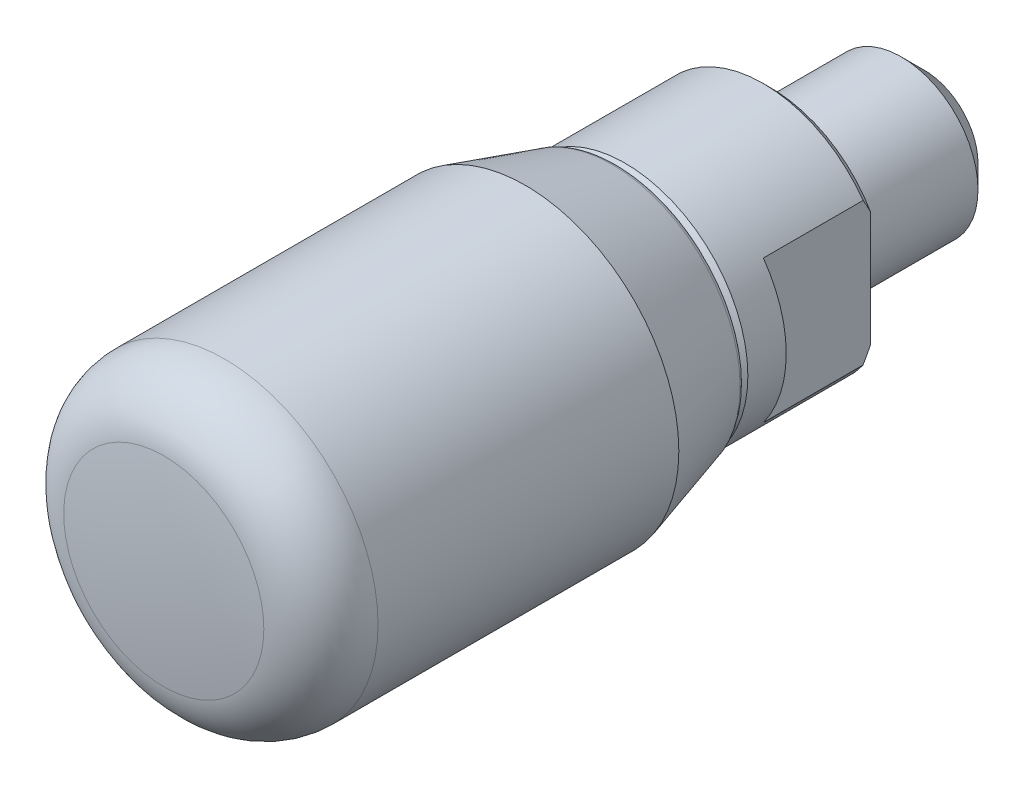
ISO-10303-21;
HEADER;
FILE_DESCRIPTION(('STEP AP214'),'2;1');
FILE_NAME('part.step','',(''),(''),'','','');
FILE_SCHEMA(('AUTOMOTIVE_DESIGN { 1 0 10303 214 1 1 1 1 }'));
ENDSEC;
DATA;
#1=APPLICATION_CONTEXT('core data for automotive mechanical design processes');
#2=APPLICATION_PROTOCOL_DEFINITION('international standard','automotive_design',2000,#1);
#3=PRODUCT_CONTEXT('',#1,'mechanical');
#4=PRODUCT('Part','Part','',(#3));
#5=PRODUCT_RELATED_PRODUCT_CATEGORY('part','',(#4));
#6=PRODUCT_DEFINITION_FORMATION('','',#4);
#7=PRODUCT_DEFINITION_CONTEXT('part definition',#1,'design');
#8=PRODUCT_DEFINITION('design','',#6,#7);
#9=PRODUCT_DEFINITION_SHAPE('','',#8);
#10=(LENGTH_UNIT() NAMED_UNIT(*) SI_UNIT(.MILLI.,.METRE.));
#11=(NAMED_UNIT(*) PLANE_ANGLE_UNIT() SI_UNIT($,.RADIAN.));
#12=(NAMED_UNIT(*) SI_UNIT($,.STERADIAN.) SOLID_ANGLE_UNIT());
#13=UNCERTAINTY_MEASURE_WITH_UNIT(LENGTH_MEASURE(1.E-05),#10,'distance_accuracy_value','');
#14=(GEOMETRIC_REPRESENTATION_CONTEXT(3) GLOBAL_UNCERTAINTY_ASSIGNED_CONTEXT((#13)) GLOBAL_UNIT_ASSIGNED_CONTEXT((#10,
#11,#12)) REPRESENTATION_CONTEXT('',''));
#15=CARTESIAN_POINT('',(0.,0.,0.));
#16=DIRECTION('',(0.,0.,1.));
#17=DIRECTION('',(1.,0.,0.));
#18=AXIS2_PLACEMENT_3D('',#15,#16,#17);
#19=CARTESIAN_POINT('',(0.,7.5,0.));
#20=DIRECTION('',(0.,0.,1.));
#21=DIRECTION('',(1.,0.,0.));
#22=AXIS2_PLACEMENT_3D('',#19,#20,#21);
#23=PLANE('',#22);
#24=CARTESIAN_POINT('',(0.,0.,0.));
#25=DIRECTION('',(0.,0.,1.));
#26=DIRECTION('',(1.,0.,0.));
#27=AXIS2_PLACEMENT_3D('',#24,#25,#26);
#28=CIRCLE('',#27,5.);
#29=CARTESIAN_POINT('',(5.,0.,0.));
#30=VERTEX_POINT('',#29);
#31=EDGE_CURVE('E201',#30,#30,#28,.T.);
#32=ORIENTED_EDGE('',*,*,#31,.T.);
#33=EDGE_LOOP('',(#32));
#34=FACE_BOUND('',#33,.T.);
#35=DIRECTION('',(0.,1.,0.));
#36=VECTOR('',#35,1.);
#37=CARTESIAN_POINT('',(-6.5,4.65000000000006,0.));
#38=LINE('',#37,#36);
#39=CARTESIAN_POINT('',(-6.5,-3.74165738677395,0.));
#40=VERTEX_POINT('',#39);
#41=CARTESIAN_POINT('',(-6.5,3.74165738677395,0.));
#42=VERTEX_POINT('',#41);
#43=EDGE_CURVE('E109',#40,#42,#38,.T.);
#44=ORIENTED_EDGE('',*,*,#43,.T.);
#45=CARTESIAN_POINT('',(0.,0.,0.));
#46=DIRECTION('',(0.,0.,1.));
#47=DIRECTION('',(1.,0.,0.));
#48=AXIS2_PLACEMENT_3D('',#45,#46,#47);
#49=CIRCLE('',#48,7.5);
#50=CARTESIAN_POINT('',(6.5,3.74165738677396,0.));
#51=VERTEX_POINT('',#50);
#52=EDGE_CURVE('E198',#51,#42,#49,.T.);
#53=ORIENTED_EDGE('',*,*,#52,.F.);
#54=DIRECTION('',(0.,1.,0.));
#55=VECTOR('',#54,1.);
#56=CARTESIAN_POINT('',(6.5,4.65000000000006,0.));
#57=LINE('',#56,#55);
#58=CARTESIAN_POINT('',(6.5,-3.74165738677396,0.));
#59=VERTEX_POINT('',#58);
#60=EDGE_CURVE('E228',#59,#51,#57,.T.);
#61=ORIENTED_EDGE('',*,*,#60,.F.);
#62=EDGE_CURVE('E192',#40,#59,#49,.T.);
#63=ORIENTED_EDGE('',*,*,#62,.F.);
#64=EDGE_LOOP('',(#44,#53,#61,#63));
#65=FACE_BOUND('',#64,.T.);
#66=ADVANCED_FACE('F14',(#34,#65),#23,.F.);
#67=CARTESIAN_POINT('',(0.,0.,0.));
#68=DIRECTION('',(0.,0.,1.));
#69=DIRECTION('',(1.,0.,0.));
#70=AXIS2_PLACEMENT_3D('',#67,#68,#69);
#71=CONICAL_SURFACE('',#70,7.5,0.785398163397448);
#72=CARTESIAN_POINT('',(-8.84375391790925,4.65000000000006,2.49172074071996));
#73=CARTESIAN_POINT('',(-8.6508304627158,4.65000000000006,2.32098526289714));
#74=CARTESIAN_POINT('',(-8.4573252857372,4.65000000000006,2.15090150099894));
#75=CARTESIAN_POINT('',(-8.06888646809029,4.65000000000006,1.81237023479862));
#76=CARTESIAN_POINT('',(-7.87395281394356,4.65000000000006,1.64392274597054));
#77=CARTESIAN_POINT('',(-7.48261562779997,4.65000000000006,1.30918824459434));
#78=CARTESIAN_POINT('',(-7.28621399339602,4.65000000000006,1.14289901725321));
#79=CARTESIAN_POINT('',(-6.89137826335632,4.65000000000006,0.812752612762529));
#80=CARTESIAN_POINT('',(-6.69294419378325,4.65000000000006,0.648895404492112));
#81=CARTESIAN_POINT('',(-6.29340367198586,4.65000000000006,0.324057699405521));
#82=CARTESIAN_POINT('',(-6.09229477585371,4.65000000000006,0.163080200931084));
#83=CARTESIAN_POINT('',(-5.68705105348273,4.65000000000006,-0.154982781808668));
#84=CARTESIAN_POINT('',(-5.48291656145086,4.65000000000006,-0.312068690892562));
#85=CARTESIAN_POINT('',(-5.07062725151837,4.65000000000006,-0.62140057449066));
#86=CARTESIAN_POINT('',(-4.86246813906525,4.65000000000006,-0.773640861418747));
#87=CARTESIAN_POINT('',(-4.54663856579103,4.65000000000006,-0.997008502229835));
#88=CARTESIAN_POINT('',(-4.44074311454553,4.65000000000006,-1.0706457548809));
#89=CARTESIAN_POINT('',(-4.22760595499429,4.65000000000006,-1.21596462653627));
#90=CARTESIAN_POINT('',(-4.12036412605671,4.65000000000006,-1.2876460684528));
#91=CARTESIAN_POINT('',(-4.01237778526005,4.65000000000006,-1.35820258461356));
#92=B_SPLINE_CURVE_WITH_KNOTS('',3,(#72,#73,#74,#75,#76,#77,#78,#79,#80,#81,#82,#83,#84,#85,#86,
#87,#88,#89,#90,#91),.UNSPECIFIED.,.F.,.F.,(4,2,2,2,2,2,2,2,2,4),(0.,0.77287569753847,
1.54575869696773,2.31777330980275,3.08977803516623,3.86254458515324,4.63522640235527,
5.40878400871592,5.79570973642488,6.18267038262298),.UNSPECIFIED.);
#93=CARTESIAN_POINT('',(-6.50980030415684,4.65000000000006,0.5));
#94=VERTEX_POINT('',#93);
#95=CARTESIAN_POINT('',(-6.5,4.65000000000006,0.492027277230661));
#96=VERTEX_POINT('',#95);
#97=EDGE_CURVE('E104',#94,#96,#92,.T.);
#98=ORIENTED_EDGE('',*,*,#97,.F.);
#99=CARTESIAN_POINT('',(0.,0.,0.5));
#100=DIRECTION('',(0.,0.,1.));
#101=DIRECTION('',(1.,0.,0.));
#102=AXIS2_PLACEMENT_3D('',#99,#100,#101);
#103=CIRCLE('',#102,8.);
#104=CARTESIAN_POINT('',(6.50980030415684,4.65000000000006,0.5));
#105=VERTEX_POINT('',#104);
#106=EDGE_CURVE('E188',#105,#94,#103,.T.);
#107=ORIENTED_EDGE('',*,*,#106,.F.);
#108=CARTESIAN_POINT('',(8.84375391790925,4.65000000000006,2.49172074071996));
#109=CARTESIAN_POINT('',(8.6508304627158,4.65000000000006,2.32098526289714));
#110=CARTESIAN_POINT('',(8.4573252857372,4.65000000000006,2.15090150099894));
#111=CARTESIAN_POINT('',(8.06888646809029,4.65000000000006,1.81237023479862));
#112=CARTESIAN_POINT('',(7.87395281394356,4.65000000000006,1.64392274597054));
#113=CARTESIAN_POINT('',(7.48261562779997,4.65000000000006,1.30918824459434));
#114=CARTESIAN_POINT('',(7.28621399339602,4.65000000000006,1.14289901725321));
#115=CARTESIAN_POINT('',(6.89137826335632,4.65000000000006,0.81275261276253));
#116=CARTESIAN_POINT('',(6.69294419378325,4.65000000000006,0.648895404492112));
#117=CARTESIAN_POINT('',(6.29340367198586,4.65000000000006,0.32405769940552));
#118=CARTESIAN_POINT('',(6.09229477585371,4.65000000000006,0.163080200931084));
#119=CARTESIAN_POINT('',(5.68705105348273,4.65000000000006,-0.154982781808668));
#120=CARTESIAN_POINT('',(5.48291656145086,4.65000000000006,-0.312068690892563));
#121=CARTESIAN_POINT('',(5.07062725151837,4.65000000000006,-0.62140057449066));
#122=CARTESIAN_POINT('',(4.86246813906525,4.65000000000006,-0.773640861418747));
#123=CARTESIAN_POINT('',(4.54663856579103,4.65000000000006,-0.997008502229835));
#124=CARTESIAN_POINT('',(4.44074311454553,4.65000000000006,-1.0706457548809));
#125=CARTESIAN_POINT('',(4.22760595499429,4.65000000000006,-1.21596462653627));
#126=CARTESIAN_POINT('',(4.12036412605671,4.65000000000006,-1.2876460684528));
#127=CARTESIAN_POINT('',(4.01237778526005,4.65000000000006,-1.35820258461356));
#128=B_SPLINE_CURVE_WITH_KNOTS('',3,(#108,#109,#110,#111,#112,#113,#114,#115,#116,#117,#118,
#119,#120,#121,#122,#123,#124,#125,#126,#127),.UNSPECIFIED.,.F.,.F.,(4,2,2,2,2,2,2,2,2,4),(0.,
0.77287569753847,1.54575869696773,2.31777330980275,3.08977803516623,3.86254458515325,
4.63522640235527,5.40878400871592,5.79570973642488,6.18267038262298),.UNSPECIFIED.);
#129=CARTESIAN_POINT('',(6.5,4.65000000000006,0.492027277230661));
#130=VERTEX_POINT('',#129);
#131=EDGE_CURVE('E222',#105,#130,#128,.T.);
#132=ORIENTED_EDGE('',*,*,#131,.T.);
#133=CARTESIAN_POINT('',(6.5,-10.2382586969,4.62732209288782));
#134=CARTESIAN_POINT('',(6.5,-10.0805675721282,4.49419858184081));
#135=CARTESIAN_POINT('',(6.5,-9.92244567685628,4.36158577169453));
#136=CARTESIAN_POINT('',(6.5,-9.60522522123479,4.09752611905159));
#137=CARTESIAN_POINT('',(6.5,-9.4461266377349,3.9660793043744));
#138=CARTESIAN_POINT('',(6.5,-8.96701551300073,3.57355939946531));
#139=CARTESIAN_POINT('',(6.5,-8.64537396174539,3.3144647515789));
#140=CARTESIAN_POINT('',(6.5,-7.98463041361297,2.79375612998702));
#141=CARTESIAN_POINT('',(6.5,-7.64532241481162,2.53240287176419));
#142=CARTESIAN_POINT('',(6.5,-6.95917981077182,2.01987283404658));
#143=CARTESIAN_POINT('',(6.5,-6.61234731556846,1.76869325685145));
#144=CARTESIAN_POINT('',(6.5,-6.08417080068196,1.40230988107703));
#145=CARTESIAN_POINT('',(6.5,-5.90653957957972,1.28175363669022));
#146=CARTESIAN_POINT('',(6.5,-5.5483970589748,1.04497638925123));
#147=CARTESIAN_POINT('',(6.5,-5.36788571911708,0.928755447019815));
#148=CARTESIAN_POINT('',(6.5,-5.00339058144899,0.701439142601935));
#149=CARTESIAN_POINT('',(6.5,-4.8194033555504,0.590349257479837));
#150=CARTESIAN_POINT('',(6.5,-4.44769324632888,0.374583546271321));
#151=CARTESIAN_POINT('',(6.5,-4.2599704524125,0.269907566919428));
#152=CARTESIAN_POINT('',(6.5,-3.88317362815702,0.069935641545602));
#153=CARTESIAN_POINT('',(6.5,-3.69416215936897,-0.0254775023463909));
#154=CARTESIAN_POINT('',(6.5,-3.31163803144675,-0.206948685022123));
#155=CARTESIAN_POINT('',(6.5,-3.1181248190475,-0.293005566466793));
#156=CARTESIAN_POINT('',(6.5,-2.72674297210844,-0.453486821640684));
#157=CARTESIAN_POINT('',(6.5,-2.52888387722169,-0.527934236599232));
#158=CARTESIAN_POINT('',(6.5,-2.12853570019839,-0.662954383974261));
#159=CARTESIAN_POINT('',(6.5,-1.92604884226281,-0.723533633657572));
#160=CARTESIAN_POINT('',(6.5,-1.51349336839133,-0.829145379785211));
#161=CARTESIAN_POINT('',(6.5,-1.30335505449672,-0.873909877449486));
#162=CARTESIAN_POINT('',(6.5,-0.879838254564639,-0.944044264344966));
#163=CARTESIAN_POINT('',(6.5,-0.666460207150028,-0.969416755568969));
#164=CARTESIAN_POINT('',(6.5,-0.238874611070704,-0.999097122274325));
#165=CARTESIAN_POINT('',(6.5,-0.0246716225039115,-1.00346945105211));
#166=CARTESIAN_POINT('',(6.5,0.403120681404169,-0.991023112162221));
#167=CARTESIAN_POINT('',(6.5,0.616709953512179,-0.974202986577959));
#168=CARTESIAN_POINT('',(6.5,1.03895684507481,-0.920789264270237));
#169=CARTESIAN_POINT('',(6.5,1.24764287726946,-0.884416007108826));
#170=CARTESIAN_POINT('',(6.5,1.66114540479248,-0.79413327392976));
#171=CARTESIAN_POINT('',(6.5,1.86596146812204,-0.740221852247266));
#172=CARTESIAN_POINT('',(6.5,2.27370482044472,-0.616580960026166));
#173=CARTESIAN_POINT('',(6.5,2.47657034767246,-0.546649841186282));
#174=CARTESIAN_POINT('',(6.5,2.77713345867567,-0.432193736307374));
#175=CARTESIAN_POINT('',(6.5,2.876692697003,-0.392451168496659));
#176=CARTESIAN_POINT('',(6.5,3.07460512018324,-0.31006843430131));
#177=CARTESIAN_POINT('',(6.5,3.17295830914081,-0.267428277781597));
#178=CARTESIAN_POINT('',(6.5,3.60701601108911,-0.0723406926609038));
#179=CARTESIAN_POINT('',(6.5,3.93641756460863,0.094220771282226));
#180=CARTESIAN_POINT('',(6.5,4.58347580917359,0.448899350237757));
#181=CARTESIAN_POINT('',(6.5,4.90112133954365,0.637036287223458));
#182=CARTESIAN_POINT('',(6.5,5.52825977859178,1.02945674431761));
#183=CARTESIAN_POINT('',(6.5,5.83770800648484,1.23381115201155));
#184=CARTESIAN_POINT('',(6.5,6.4487942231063,1.65356252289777));
#185=CARTESIAN_POINT('',(6.5,6.75043494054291,1.86895554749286));
#186=CARTESIAN_POINT('',(6.5,7.32422713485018,2.29079000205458));
#187=CARTESIAN_POINT('',(6.5,7.59683738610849,2.49661052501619));
#188=CARTESIAN_POINT('',(6.5,8.1378805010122,2.9137139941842));
#189=CARTESIAN_POINT('',(6.5,8.40631291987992,3.12499751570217));
#190=CARTESIAN_POINT('',(6.5,8.93692438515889,3.54959310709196));
#191=CARTESIAN_POINT('',(6.5,9.19913953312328,3.76286019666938));
#192=CARTESIAN_POINT('',(6.5,9.72069775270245,4.1927544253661));
#193=CARTESIAN_POINT('',(6.5,9.98004149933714,4.40938074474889));
#194=CARTESIAN_POINT('',(6.5,10.2382586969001,4.62732209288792));
#195=B_SPLINE_CURVE_WITH_KNOTS('',3,(#133,#134,#135,#136,#137,#138,#139,#140,#141,#142,#143,
#144,#145,#146,#147,#148,#149,#150,#151,#152,#153,#154,#155,#156,#157,#158,#159,#160,#161,#162,
#163,#164,#165,#166,#167,#168,#169,#170,#171,#172,#173,#174,#175,#176,#177,#178,#179,#180,#181,
#182,#183,#184,#185,#186,#187,#188,#189,#190,#191,#192,#193,#194),.UNSPECIFIED.,.F.,.F.,(4,2,2,
2,2,2,2,2,2,2,2,2,2,2,2,2,2,2,2,2,2,2,2,2,2,2,2,2,2,2,4),(0.,0.619106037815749,1.23822680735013,
2.47720106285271,3.76196003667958,5.04636327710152,5.69034800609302,6.33434176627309,
6.97900777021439,7.62365836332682,8.25863408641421,8.89368826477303,9.5274655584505,
10.1609443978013,10.8046943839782,11.4483579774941,12.0900447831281,12.7317757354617,
13.3664222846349,14.0011392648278,14.6443334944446,14.9658915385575,15.2874484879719,
16.3934514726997,17.5004788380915,18.6126441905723,19.7244154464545,20.749078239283,
21.7738493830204,22.7877992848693,23.8015055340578),.UNSPECIFIED.);
#196=EDGE_CURVE('E163',#51,#130,#195,.T.);
#197=ORIENTED_EDGE('',*,*,#196,.F.);
#198=ORIENTED_EDGE('',*,*,#52,.T.);
#199=CARTESIAN_POINT('',(-6.5,10.2382586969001,4.62732209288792));
#200=CARTESIAN_POINT('',(-6.5,10.0805675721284,4.49419858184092));
#201=CARTESIAN_POINT('',(-6.5,9.92244567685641,4.36158577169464));
#202=CARTESIAN_POINT('',(-6.5,9.60522522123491,4.0975261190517));
#203=CARTESIAN_POINT('',(-6.5,9.44612663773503,3.9660793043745));
#204=CARTESIAN_POINT('',(-6.5,8.96701551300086,3.57355939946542));
#205=CARTESIAN_POINT('',(-6.5,8.64537396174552,3.314464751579));
#206=CARTESIAN_POINT('',(-6.5,7.9846304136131,2.79375612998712));
#207=CARTESIAN_POINT('',(-6.5,7.64532241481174,2.53240287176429));
#208=CARTESIAN_POINT('',(-6.5,6.95917981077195,2.01987283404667));
#209=CARTESIAN_POINT('',(-6.5,6.6123473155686,1.76869325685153));
#210=CARTESIAN_POINT('',(-6.5,6.0841708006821,1.40230988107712));
#211=CARTESIAN_POINT('',(-6.5,5.90653957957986,1.28175363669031));
#212=CARTESIAN_POINT('',(-6.5,5.54839705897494,1.04497638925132));
#213=CARTESIAN_POINT('',(-6.5,5.36788571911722,0.928755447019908));
#214=CARTESIAN_POINT('',(-6.5,5.00339058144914,0.701439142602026));
#215=CARTESIAN_POINT('',(-6.5,4.81940335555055,0.590349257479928));
#216=CARTESIAN_POINT('',(-6.5,4.44769324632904,0.37458354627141));
#217=CARTESIAN_POINT('',(-6.5,4.25997045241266,0.269907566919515));
#218=CARTESIAN_POINT('',(-6.5,3.88317362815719,0.069935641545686));
#219=CARTESIAN_POINT('',(-6.5,3.69416215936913,-0.0254775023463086));
#220=CARTESIAN_POINT('',(-6.5,3.31163803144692,-0.206948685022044));
#221=CARTESIAN_POINT('',(-6.5,3.11812481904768,-0.293005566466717));
#222=CARTESIAN_POINT('',(-6.5,2.72674297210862,-0.453486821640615));
#223=CARTESIAN_POINT('',(-6.5,2.52888387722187,-0.527934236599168));
#224=CARTESIAN_POINT('',(-6.5,2.12853570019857,-0.662954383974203));
#225=CARTESIAN_POINT('',(-6.5,1.92604884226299,-0.723533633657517));
#226=CARTESIAN_POINT('',(-6.5,1.51349336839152,-0.829145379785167));
#227=CARTESIAN_POINT('',(-6.5,1.30335505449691,-0.873909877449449));
#228=CARTESIAN_POINT('',(-6.5,0.879838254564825,-0.944044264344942));
#229=CARTESIAN_POINT('',(-6.5,0.666460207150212,-0.969416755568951));
#230=CARTESIAN_POINT('',(-6.5,0.238874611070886,-0.999097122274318));
#231=CARTESIAN_POINT('',(-6.5,0.0246716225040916,-1.00346945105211));
#232=CARTESIAN_POINT('',(-6.5,-0.403120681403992,-0.991023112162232));
#233=CARTESIAN_POINT('',(-6.5,-0.616709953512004,-0.974202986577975));
#234=CARTESIAN_POINT('',(-6.5,-1.03895684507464,-0.920789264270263));
#235=CARTESIAN_POINT('',(-6.5,-1.24764287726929,-0.884416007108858));
#236=CARTESIAN_POINT('',(-6.5,-1.66114540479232,-0.794133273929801));
#237=CARTESIAN_POINT('',(-6.5,-1.86596146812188,-0.74022185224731));
#238=CARTESIAN_POINT('',(-6.5,-2.27370482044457,-0.616580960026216));
#239=CARTESIAN_POINT('',(-6.5,-2.47657034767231,-0.546649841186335));
#240=CARTESIAN_POINT('',(-6.5,-2.77713345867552,-0.432193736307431));
#241=CARTESIAN_POINT('',(-6.5,-2.87669269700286,-0.392451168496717));
#242=CARTESIAN_POINT('',(-6.5,-3.0746051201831,-0.310068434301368));
#243=CARTESIAN_POINT('',(-6.5,-3.17295830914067,-0.267428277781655));
#244=CARTESIAN_POINT('',(-6.5,-3.60701601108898,-0.0723406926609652));
#245=CARTESIAN_POINT('',(-6.5,-3.9364175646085,0.0942207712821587));
#246=CARTESIAN_POINT('',(-6.5,-4.58347580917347,0.448899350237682));
#247=CARTESIAN_POINT('',(-6.5,-4.90112133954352,0.637036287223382));
#248=CARTESIAN_POINT('',(-6.5,-5.52825977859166,1.02945674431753));
#249=CARTESIAN_POINT('',(-6.5,-5.83770800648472,1.23381115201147));
#250=CARTESIAN_POINT('',(-6.5,-6.44879422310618,1.65356252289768));
#251=CARTESIAN_POINT('',(-6.5,-6.75043494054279,1.86895554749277));
#252=CARTESIAN_POINT('',(-6.5,-7.32422713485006,2.29079000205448));
#253=CARTESIAN_POINT('',(-6.5,-7.59683738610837,2.4966105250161));
#254=CARTESIAN_POINT('',(-6.5,-8.13788050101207,2.9137139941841));
#255=CARTESIAN_POINT('',(-6.5,-8.4063129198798,3.12499751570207));
#256=CARTESIAN_POINT('',(-6.5,-8.93692438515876,3.54959310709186));
#257=CARTESIAN_POINT('',(-6.5,-9.19913953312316,3.76286019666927));
#258=CARTESIAN_POINT('',(-6.5,-9.72069775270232,4.192754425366));
#259=CARTESIAN_POINT('',(-6.5,-9.98004149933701,4.40938074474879));
#260=CARTESIAN_POINT('',(-6.5,-10.2382586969,4.62732209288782));
#261=B_SPLINE_CURVE_WITH_KNOTS('',3,(#199,#200,#201,#202,#203,#204,#205,#206,#207,#208,#209,
#210,#211,#212,#213,#214,#215,#216,#217,#218,#219,#220,#221,#222,#223,#224,#225,#226,#227,#228,
#229,#230,#231,#232,#233,#234,#235,#236,#237,#238,#239,#240,#241,#242,#243,#244,#245,#246,#247,
#248,#249,#250,#251,#252,#253,#254,#255,#256,#257,#258,#259,#260),.UNSPECIFIED.,.F.,.F.,(4,2,2,
2,2,2,2,2,2,2,2,2,2,2,2,2,2,2,2,2,2,2,2,2,2,2,2,2,2,2,4),(0.,0.619106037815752,1.23822680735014,
2.47720106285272,3.7619600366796,5.04636327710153,5.69034800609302,6.33434176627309,
6.97900777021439,7.62365836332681,8.25863408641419,8.89368826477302,9.52746555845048,
10.1609443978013,10.8046943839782,11.448357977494,12.0900447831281,12.7317757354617,
13.3664222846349,14.0011392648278,14.6443334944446,14.9658915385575,15.287448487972,
16.3934514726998,17.5004788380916,18.6126441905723,19.7244154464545,20.749078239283,
21.7738493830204,22.7877992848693,23.8015055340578),.UNSPECIFIED.);
#262=EDGE_CURVE('E9',#96,#42,#261,.T.);
#263=ORIENTED_EDGE('',*,*,#262,.F.);
#264=EDGE_LOOP('',(#98,#107,#132,#197,#198,#263));
#265=FACE_BOUND('',#264,.T.);
#266=ADVANCED_FACE('F139',(#265),#71,.T.);
#267=CARTESIAN_POINT('',(-4.0123777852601,-4.64999999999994,-1.35820258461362));
#268=CARTESIAN_POINT('',(-4.12036412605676,-4.64999999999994,-1.28764606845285));
#269=CARTESIAN_POINT('',(-4.22760595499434,-4.64999999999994,-1.21596462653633));
#270=CARTESIAN_POINT('',(-4.44074311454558,-4.64999999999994,-1.07064575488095));
#271=CARTESIAN_POINT('',(-4.54663856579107,-4.64999999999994,-0.997008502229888));
#272=CARTESIAN_POINT('',(-4.8624681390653,-4.64999999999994,-0.773640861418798));
#273=CARTESIAN_POINT('',(-5.07062725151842,-4.64999999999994,-0.621400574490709));
#274=CARTESIAN_POINT('',(-5.4829165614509,-4.64999999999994,-0.312068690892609));
#275=CARTESIAN_POINT('',(-5.68705105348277,-4.64999999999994,-0.154982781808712));
#276=CARTESIAN_POINT('',(-6.09229477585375,-4.64999999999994,0.163080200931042));
#277=CARTESIAN_POINT('',(-6.2934036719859,-4.64999999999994,0.324057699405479));
#278=CARTESIAN_POINT('',(-6.69294419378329,-4.64999999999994,0.648895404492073));
#279=CARTESIAN_POINT('',(-6.89137826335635,-4.64999999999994,0.812752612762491));
#280=CARTESIAN_POINT('',(-7.28621399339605,-4.64999999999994,1.14289901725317));
#281=CARTESIAN_POINT('',(-7.4826156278,-4.64999999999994,1.3091882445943));
#282=CARTESIAN_POINT('',(-7.87395281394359,-4.64999999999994,1.6439227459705));
#283=CARTESIAN_POINT('',(-8.06888646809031,-4.64999999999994,1.81237023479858));
#284=CARTESIAN_POINT('',(-8.45732528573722,-4.64999999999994,2.1509015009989));
#285=CARTESIAN_POINT('',(-8.65083046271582,-4.64999999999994,2.3209852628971));
#286=CARTESIAN_POINT('',(-8.84375391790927,-4.64999999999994,2.49172074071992));
#287=B_SPLINE_CURVE_WITH_KNOTS('',3,(#267,#268,#269,#270,#271,#272,#273,#274,#275,#276,#277,
#278,#279,#280,#281,#282,#283,#284,#285,#286),.UNSPECIFIED.,.F.,.F.,(4,2,2,2,2,2,2,2,2,4),(0.,
0.386960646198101,0.773886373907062,1.54744398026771,2.32012579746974,3.09289234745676,
3.86489707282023,4.63691168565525,5.4097946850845,6.18267038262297),.UNSPECIFIED.);
#288=CARTESIAN_POINT('',(-6.5,-4.64999999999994,0.492027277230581));
#289=VERTEX_POINT('',#288);
#290=CARTESIAN_POINT('',(-6.50980030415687,-4.64999999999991,0.5));
#291=VERTEX_POINT('',#290);
#292=EDGE_CURVE('E35',#289,#291,#287,.T.);
#293=ORIENTED_EDGE('',*,*,#292,.F.);
#294=EDGE_CURVE('E18',#40,#289,#261,.T.);
#295=ORIENTED_EDGE('',*,*,#294,.F.);
#296=ORIENTED_EDGE('',*,*,#62,.T.);
#297=CARTESIAN_POINT('',(6.5,-4.64999999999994,0.492027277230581));
#298=VERTEX_POINT('',#297);
#299=EDGE_CURVE('E170',#298,#59,#195,.T.);
#300=ORIENTED_EDGE('',*,*,#299,.F.);
#301=CARTESIAN_POINT('',(4.0123777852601,-4.64999999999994,-1.35820258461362));
#302=CARTESIAN_POINT('',(4.12036412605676,-4.64999999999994,-1.28764606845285));
#303=CARTESIAN_POINT('',(4.22760595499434,-4.64999999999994,-1.21596462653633));
#304=CARTESIAN_POINT('',(4.44074311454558,-4.64999999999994,-1.07064575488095));
#305=CARTESIAN_POINT('',(4.54663856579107,-4.64999999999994,-0.997008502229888));
#306=CARTESIAN_POINT('',(4.8624681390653,-4.64999999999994,-0.773640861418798));
#307=CARTESIAN_POINT('',(5.07062725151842,-4.64999999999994,-0.621400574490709));
#308=CARTESIAN_POINT('',(5.4829165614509,-4.64999999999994,-0.312068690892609));
#309=CARTESIAN_POINT('',(5.68705105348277,-4.64999999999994,-0.154982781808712));
#310=CARTESIAN_POINT('',(6.09229477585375,-4.64999999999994,0.163080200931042));
#311=CARTESIAN_POINT('',(6.2934036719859,-4.64999999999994,0.324057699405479));
#312=CARTESIAN_POINT('',(6.69294419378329,-4.64999999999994,0.648895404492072));
#313=CARTESIAN_POINT('',(6.89137826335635,-4.64999999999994,0.812752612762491));
#314=CARTESIAN_POINT('',(7.28621399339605,-4.64999999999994,1.14289901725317));
#315=CARTESIAN_POINT('',(7.4826156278,-4.64999999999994,1.3091882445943));
#316=CARTESIAN_POINT('',(7.87395281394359,-4.64999999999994,1.6439227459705));
#317=CARTESIAN_POINT('',(8.06888646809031,-4.64999999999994,1.81237023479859));
#318=CARTESIAN_POINT('',(8.45732528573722,-4.64999999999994,2.1509015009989));
#319=CARTESIAN_POINT('',(8.65083046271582,-4.64999999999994,2.3209852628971));
#320=CARTESIAN_POINT('',(8.84375391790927,-4.64999999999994,2.49172074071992));
#321=B_SPLINE_CURVE_WITH_KNOTS('',3,(#301,#302,#303,#304,#305,#306,#307,#308,#309,#310,#311,
#312,#313,#314,#315,#316,#317,#318,#319,#320),.UNSPECIFIED.,.F.,.F.,(4,2,2,2,2,2,2,2,2,4),(0.,
0.386960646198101,0.773886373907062,1.54744398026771,2.32012579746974,3.09289234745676,
3.86489707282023,4.63691168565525,5.4097946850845,6.18267038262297),.UNSPECIFIED.);
#322=CARTESIAN_POINT('',(6.50980030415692,-4.64999999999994,0.5));
#323=VERTEX_POINT('',#322);
#324=EDGE_CURVE('E185',#298,#323,#321,.T.);
#325=ORIENTED_EDGE('',*,*,#324,.T.);
#326=EDGE_CURVE('E183',#291,#323,#103,.T.);
#327=ORIENTED_EDGE('',*,*,#326,.F.);
#328=EDGE_LOOP('',(#293,#295,#296,#300,#325,#327));
#329=FACE_BOUND('',#328,.T.);
#330=ADVANCED_FACE('F181',(#329),#71,.T.);
#331=CARTESIAN_POINT('',(0.,0.,45.));
#332=DIRECTION('',(0.,0.,1.));
#333=DIRECTION('',(1.,0.,0.));
#334=AXIS2_PLACEMENT_3D('',#331,#332,#333);
#335=CYLINDRICAL_SURFACE('',#334,8.);
#336=CARTESIAN_POINT('',(0.,0.,9.5));
#337=DIRECTION('',(0.,0.,1.));
#338=DIRECTION('',(1.,0.,0.));
#339=AXIS2_PLACEMENT_3D('',#336,#337,#338);
#340=CIRCLE('',#339,8.00000000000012);
#341=CARTESIAN_POINT('',(8.00000000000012,0.,9.5));
#342=VERTEX_POINT('',#341);
#343=EDGE_CURVE('E189',#342,#342,#340,.T.);
#344=ORIENTED_EDGE('',*,*,#343,.F.);
#345=EDGE_LOOP('',(#344));
#346=FACE_BOUND('',#345,.T.);
#347=DIRECTION('',(0.,0.,1.));
#348=VECTOR('',#347,1.);
#349=CARTESIAN_POINT('',(-6.50980030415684,4.65000000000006,45.));
#350=LINE('',#349,#348);
#351=CARTESIAN_POINT('',(-6.50980030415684,4.65000000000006,7.));
#352=VERTEX_POINT('',#351);
#353=EDGE_CURVE('E175',#352,#94,#350,.F.);
#354=ORIENTED_EDGE('',*,*,#353,.F.);
#355=CARTESIAN_POINT('',(0.,0.,7.));
#356=DIRECTION('',(0.,0.,-1.));
#357=DIRECTION('',(-1.,0.,0.));
#358=AXIS2_PLACEMENT_3D('',#355,#356,#357);
#359=CIRCLE('',#358,8.);
#360=CARTESIAN_POINT('',(-6.50980030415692,-4.64999999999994,7.));
#361=VERTEX_POINT('',#360);
#362=EDGE_CURVE('E116',#361,#352,#359,.T.);
#363=ORIENTED_EDGE('',*,*,#362,.F.);
#364=DIRECTION('',(0.,0.,1.));
#365=VECTOR('',#364,1.);
#366=CARTESIAN_POINT('',(-6.50980030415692,-4.64999999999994,45.));
#367=LINE('',#366,#365);
#368=EDGE_CURVE('E174',#291,#361,#367,.T.);
#369=ORIENTED_EDGE('',*,*,#368,.F.);
#370=ORIENTED_EDGE('',*,*,#326,.T.);
#371=DIRECTION('',(0.,0.,1.));
#372=VECTOR('',#371,1.);
#373=CARTESIAN_POINT('',(6.50980030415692,-4.64999999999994,45.));
#374=LINE('',#373,#372);
#375=CARTESIAN_POINT('',(6.50980030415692,-4.64999999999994,7.));
#376=VERTEX_POINT('',#375);
#377=EDGE_CURVE('E211',#323,#376,#374,.T.);
#378=ORIENTED_EDGE('',*,*,#377,.T.);
#379=CARTESIAN_POINT('',(0.,0.,7.));
#380=DIRECTION('',(0.,0.,1.));
#381=DIRECTION('',(1.,0.,0.));
#382=AXIS2_PLACEMENT_3D('',#379,#380,#381);
#383=CIRCLE('',#382,8.);
#384=CARTESIAN_POINT('',(6.50980030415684,4.65000000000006,7.));
#385=VERTEX_POINT('',#384);
#386=EDGE_CURVE('E210',#376,#385,#383,.T.);
#387=ORIENTED_EDGE('',*,*,#386,.T.);
#388=DIRECTION('',(0.,0.,1.));
#389=VECTOR('',#388,1.);
#390=CARTESIAN_POINT('',(6.50980030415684,4.65000000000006,45.));
#391=LINE('',#390,#389);
#392=EDGE_CURVE('E171',#385,#105,#391,.F.);
#393=ORIENTED_EDGE('',*,*,#392,.T.);
#394=ORIENTED_EDGE('',*,*,#106,.T.);
#395=EDGE_LOOP('',(#354,#363,#369,#370,#378,#387,#393,#394));
#396=FACE_BOUND('',#395,.T.);
#397=ADVANCED_FACE('F215',(#346,#396),#335,.T.);
#398=CARTESIAN_POINT('',(0.,0.,-10.));
#399=DIRECTION('',(0.,0.,1.));
#400=DIRECTION('',(0.,1.,0.));
#401=AXIS2_PLACEMENT_3D('',#398,#399,#400);
#402=SPHERICAL_SURFACE('',#401,50.);
#403=CARTESIAN_POINT('',(0.,0.,39.5728445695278));
#404=DIRECTION('',(0.,0.,1.));
#405=DIRECTION('',(1.,0.,0.));
#406=AXIS2_PLACEMENT_3D('',#403,#404,#405);
#407=CIRCLE('',#406,6.5217391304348);
#408=CARTESIAN_POINT('',(6.5217391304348,0.,39.5728445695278));
#409=VERTEX_POINT('',#408);
#410=EDGE_CURVE('E448',#409,#409,#407,.T.);
#411=ORIENTED_EDGE('',*,*,#410,.T.);
#412=EDGE_LOOP('',(#411));
#413=FACE_BOUND('',#412,.T.);
#414=ADVANCED_FACE('F16',(#413),#402,.T.);
#415=CARTESIAN_POINT('',(0.,3.5,-10.));
#416=DIRECTION('',(0.,0.,1.));
#417=DIRECTION('',(1.,0.,0.));
#418=AXIS2_PLACEMENT_3D('',#415,#416,#417);
#419=PLANE('',#418);
#420=CARTESIAN_POINT('',(0.,0.,-10.));
#421=DIRECTION('',(0.,0.,1.));
#422=DIRECTION('',(1.,0.,0.));
#423=AXIS2_PLACEMENT_3D('',#420,#421,#422);
#424=CIRCLE('',#423,3.5);
#425=CARTESIAN_POINT('',(3.5,0.,-10.));
#426=VERTEX_POINT('',#425);
#427=EDGE_CURVE('E207',#426,#426,#424,.T.);
#428=ORIENTED_EDGE('',*,*,#427,.F.);
#429=EDGE_LOOP('',(#428));
#430=FACE_BOUND('',#429,.T.);
#431=ADVANCED_FACE('F285',(#430),#419,.F.);
#432=CARTESIAN_POINT('',(0.,0.,-10.));
#433=DIRECTION('',(0.,0.,1.));
#434=DIRECTION('',(1.,0.,0.));
#435=AXIS2_PLACEMENT_3D('',#432,#433,#434);
#436=CONICAL_SURFACE('',#435,3.5,0.785398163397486);
#437=CARTESIAN_POINT('',(0.,0.,-8.50000000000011));
#438=DIRECTION('',(0.,0.,1.));
#439=DIRECTION('',(1.,0.,0.));
#440=AXIS2_PLACEMENT_3D('',#437,#438,#439);
#441=CIRCLE('',#440,5.);
#442=CARTESIAN_POINT('',(5.,0.,-8.50000000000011));
#443=VERTEX_POINT('',#442);
#444=EDGE_CURVE('E204',#443,#443,#441,.T.);
#445=ORIENTED_EDGE('',*,*,#444,.F.);
#446=EDGE_LOOP('',(#445));
#447=FACE_BOUND('',#446,.T.);
#448=ORIENTED_EDGE('',*,*,#427,.T.);
#449=EDGE_LOOP('',(#448));
#450=FACE_BOUND('',#449,.T.);
#451=ADVANCED_FACE('F298',(#447,#450),#436,.T.);
#452=CARTESIAN_POINT('',(0.,0.,45.));
#453=DIRECTION('',(0.,0.,1.));
#454=DIRECTION('',(1.,0.,0.));
#455=AXIS2_PLACEMENT_3D('',#452,#453,#454);
#456=CYLINDRICAL_SURFACE('',#455,5.);
#457=ORIENTED_EDGE('',*,*,#31,.F.);
#458=EDGE_LOOP('',(#457));
#459=FACE_BOUND('',#458,.T.);
#460=ORIENTED_EDGE('',*,*,#444,.T.);
#461=EDGE_LOOP('',(#460));
#462=FACE_BOUND('',#461,.T.);
#463=ADVANCED_FACE('F275',(#459,#462),#456,.T.);
#464=CARTESIAN_POINT('',(0.,0.,9.5));
#465=DIRECTION('',(0.,0.,-1.));
#466=DIRECTION('',(-1.,0.,0.));
#467=AXIS2_PLACEMENT_3D('',#464,#465,#466);
#468=CONICAL_SURFACE('',#467,8.00000000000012,0.785398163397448);
#469=CARTESIAN_POINT('',(0.,0.,10.));
#470=DIRECTION('',(0.,0.,1.));
#471=DIRECTION('',(1.,0.,0.));
#472=AXIS2_PLACEMENT_3D('',#469,#470,#471);
#473=CIRCLE('',#472,7.50000000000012);
#474=CARTESIAN_POINT('',(7.50000000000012,0.,10.));
#475=VERTEX_POINT('',#474);
#476=EDGE_CURVE('E194',#475,#475,#473,.T.);
#477=ORIENTED_EDGE('',*,*,#476,.F.);
#478=EDGE_LOOP('',(#477));
#479=FACE_BOUND('',#478,.T.);
#480=ORIENTED_EDGE('',*,*,#343,.T.);
#481=EDGE_LOOP('',(#480));
#482=FACE_BOUND('',#481,.T.);
#483=ADVANCED_FACE('F272',(#479,#482),#468,.T.);
#484=CARTESIAN_POINT('',(0.,7.87499999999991,10.));
#485=DIRECTION('',(0.,0.,1.));
#486=DIRECTION('',(1.,0.,0.));
#487=AXIS2_PLACEMENT_3D('',#484,#485,#486);
#488=PLANE('',#487);
#489=CARTESIAN_POINT('',(0.,0.,10.));
#490=DIRECTION('',(0.,0.,1.));
#491=DIRECTION('',(1.,0.,0.));
#492=AXIS2_PLACEMENT_3D('',#489,#490,#491);
#493=CIRCLE('',#492,7.87499999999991);
#494=CARTESIAN_POINT('',(7.87499999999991,0.,10.));
#495=VERTEX_POINT('',#494);
#496=EDGE_CURVE('E461',#495,#495,#493,.T.);
#497=ORIENTED_EDGE('',*,*,#496,.F.);
#498=EDGE_LOOP('',(#497));
#499=FACE_BOUND('',#498,.T.);
#500=ORIENTED_EDGE('',*,*,#476,.T.);
#501=EDGE_LOOP('',(#500));
#502=FACE_BOUND('',#501,.T.);
#503=ADVANCED_FACE('F268',(#499,#502),#488,.F.);
#504=CARTESIAN_POINT('',(0.,0.,10.5));
#505=DIRECTION('',(0.,0.,1.));
#506=DIRECTION('',(1.,0.,0.));
#507=AXIS2_PLACEMENT_3D('',#504,#505,#506);
#508=TOROIDAL_SURFACE('',#507,7.87499999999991,0.5);
#509=CARTESIAN_POINT('',(0.,0.,10.36));
#510=DIRECTION('',(0.,0.,1.));
#511=DIRECTION('',(1.,0.,0.));
#512=AXIS2_PLACEMENT_3D('',#509,#510,#511);
#513=CIRCLE('',#512,8.355);
#514=CARTESIAN_POINT('',(8.355,0.,10.36));
#515=VERTEX_POINT('',#514);
#516=EDGE_CURVE('E458',#515,#515,#513,.T.);
#517=ORIENTED_EDGE('',*,*,#516,.F.);
#518=EDGE_LOOP('',(#517));
#519=FACE_BOUND('',#518,.T.);
#520=ORIENTED_EDGE('',*,*,#496,.T.);
#521=EDGE_LOOP('',(#520));
#522=FACE_BOUND('',#521,.T.);
#523=ADVANCED_FACE('F264',(#519,#522),#508,.T.);
#524=CARTESIAN_POINT('',(0.,0.,10.36));
#525=DIRECTION('',(0.,0.,1.));
#526=DIRECTION('',(1.,0.,0.));
#527=AXIS2_PLACEMENT_3D('',#524,#525,#526);
#528=CONICAL_SURFACE('',#527,8.355,0.283794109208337);
#529=CARTESIAN_POINT('',(0.,0.,16.));
#530=DIRECTION('',(0.,0.,1.));
#531=DIRECTION('',(1.,0.,0.));
#532=AXIS2_PLACEMENT_3D('',#529,#530,#531);
#533=CIRCLE('',#532,10.);
#534=CARTESIAN_POINT('',(10.,0.,16.));
#535=VERTEX_POINT('',#534);
#536=EDGE_CURVE('E453',#535,#535,#533,.T.);
#537=ORIENTED_EDGE('',*,*,#536,.F.);
#538=EDGE_LOOP('',(#537));
#539=FACE_BOUND('',#538,.T.);
#540=ORIENTED_EDGE('',*,*,#516,.T.);
#541=EDGE_LOOP('',(#540));
#542=FACE_BOUND('',#541,.T.);
#543=ADVANCED_FACE('F260',(#539,#542),#528,.T.);
#544=CARTESIAN_POINT('',(0.,0.,45.));
#545=DIRECTION('',(0.,0.,1.));
#546=DIRECTION('',(1.,0.,0.));
#547=AXIS2_PLACEMENT_3D('',#544,#545,#546);
#548=CYLINDRICAL_SURFACE('',#547,10.);
#549=CARTESIAN_POINT('',(0.,0.,35.6070170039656));
#550=DIRECTION('',(0.,0.,1.));
#551=DIRECTION('',(1.,0.,0.));
#552=AXIS2_PLACEMENT_3D('',#549,#550,#551);
#553=CIRCLE('',#552,10.);
#554=CARTESIAN_POINT('',(10.,0.,35.6070170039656));
#555=VERTEX_POINT('',#554);
#556=EDGE_CURVE('E450',#555,#555,#553,.T.);
#557=ORIENTED_EDGE('',*,*,#556,.F.);
#558=EDGE_LOOP('',(#557));
#559=FACE_BOUND('',#558,.T.);
#560=ORIENTED_EDGE('',*,*,#536,.T.);
#561=EDGE_LOOP('',(#560));
#562=FACE_BOUND('',#561,.T.);
#563=ADVANCED_FACE('F256',(#559,#562),#548,.T.);
#564=CARTESIAN_POINT('',(0.,0.,35.6070170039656));
#565=DIRECTION('',(0.,0.,1.));
#566=DIRECTION('',(1.,0.,0.));
#567=AXIS2_PLACEMENT_3D('',#564,#565,#566);
#568=TOROIDAL_SURFACE('',#567,6.,4.);
#569=ORIENTED_EDGE('',*,*,#410,.F.);
#570=EDGE_LOOP('',(#569));
#571=FACE_BOUND('',#570,.T.);
#572=ORIENTED_EDGE('',*,*,#556,.T.);
#573=EDGE_LOOP('',(#572));
#574=FACE_BOUND('',#573,.T.);
#575=ADVANCED_FACE('F157',(#571,#574),#568,.T.);
#576=CARTESIAN_POINT('',(6.5,-4.64999999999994,7.));
#577=DIRECTION('',(1.,0.,0.));
#578=DIRECTION('',(0.,0.,-1.));
#579=AXIS2_PLACEMENT_3D('',#576,#577,#578);
#580=PLANE('',#579);
#581=ORIENTED_EDGE('',*,*,#299,.T.);
#582=ORIENTED_EDGE('',*,*,#60,.T.);
#583=ORIENTED_EDGE('',*,*,#196,.T.);
#584=DIRECTION('',(0.,0.,1.));
#585=VECTOR('',#584,1.);
#586=CARTESIAN_POINT('',(6.5,4.65000000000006,7.));
#587=LINE('',#586,#585);
#588=CARTESIAN_POINT('',(6.5,4.65000000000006,7.));
#589=VERTEX_POINT('',#588);
#590=EDGE_CURVE('E232',#130,#589,#587,.T.);
#591=ORIENTED_EDGE('',*,*,#590,.T.);
#592=DIRECTION('',(0.,-1.,0.));
#593=VECTOR('',#592,1.);
#594=CARTESIAN_POINT('',(6.5,4.65000000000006,7.));
#595=LINE('',#594,#593);
#596=CARTESIAN_POINT('',(6.5,-4.64999999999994,7.));
#597=VERTEX_POINT('',#596);
#598=EDGE_CURVE('E223',#589,#597,#595,.T.);
#599=ORIENTED_EDGE('',*,*,#598,.T.);
#600=DIRECTION('',(0.,0.,-1.));
#601=VECTOR('',#600,1.);
#602=CARTESIAN_POINT('',(6.5,-4.64999999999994,7.));
#603=LINE('',#602,#601);
#604=EDGE_CURVE('E225',#597,#298,#603,.T.);
#605=ORIENTED_EDGE('',*,*,#604,.T.);
#606=EDGE_LOOP('',(#581,#582,#583,#591,#599,#605));
#607=FACE_BOUND('',#606,.T.);
#608=ADVANCED_FACE('F152',(#607),#580,.T.);
#609=CARTESIAN_POINT('',(6.5,4.65000000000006,7.));
#610=DIRECTION('',(0.,0.,1.));
#611=DIRECTION('',(1.,0.,0.));
#612=AXIS2_PLACEMENT_3D('',#609,#610,#611);
#613=PLANE('',#612);
#614=ORIENTED_EDGE('',*,*,#386,.F.);
#615=DIRECTION('',(1.,0.,0.));
#616=VECTOR('',#615,1.);
#617=CARTESIAN_POINT('',(6.5,-4.64999999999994,7.));
#618=LINE('',#617,#616);
#619=EDGE_CURVE('E43',#597,#376,#618,.T.);
#620=ORIENTED_EDGE('',*,*,#619,.F.);
#621=ORIENTED_EDGE('',*,*,#598,.F.);
#622=DIRECTION('',(1.,0.,0.));
#623=VECTOR('',#622,1.);
#624=CARTESIAN_POINT('',(6.5,4.65000000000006,7.));
#625=LINE('',#624,#623);
#626=EDGE_CURVE('E234',#589,#385,#625,.T.);
#627=ORIENTED_EDGE('',*,*,#626,.T.);
#628=EDGE_LOOP('',(#614,#620,#621,#627));
#629=FACE_BOUND('',#628,.T.);
#630=ADVANCED_FACE('F156',(#629),#613,.F.);
#631=CARTESIAN_POINT('',(6.5,4.65000000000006,7.));
#632=DIRECTION('',(0.,1.,0.));
#633=DIRECTION('',(1.,0.,0.));
#634=AXIS2_PLACEMENT_3D('',#631,#632,#633);
#635=PLANE('',#634);
#636=ORIENTED_EDGE('',*,*,#392,.F.);
#637=ORIENTED_EDGE('',*,*,#626,.F.);
#638=ORIENTED_EDGE('',*,*,#590,.F.);
#639=ORIENTED_EDGE('',*,*,#131,.F.);
#640=EDGE_LOOP('',(#636,#637,#638,#639));
#641=FACE_BOUND('',#640,.T.);
#642=ADVANCED_FACE('F159',(#641),#635,.F.);
#643=CARTESIAN_POINT('',(6.5,-4.64999999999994,7.));
#644=DIRECTION('',(0.,-1.,0.));
#645=DIRECTION('',(-1.,0.,0.));
#646=AXIS2_PLACEMENT_3D('',#643,#644,#645);
#647=PLANE('',#646);
#648=ORIENTED_EDGE('',*,*,#604,.F.);
#649=ORIENTED_EDGE('',*,*,#619,.T.);
#650=ORIENTED_EDGE('',*,*,#377,.F.);
#651=ORIENTED_EDGE('',*,*,#324,.F.);
#652=EDGE_LOOP('',(#648,#649,#650,#651));
#653=FACE_BOUND('',#652,.T.);
#654=ADVANCED_FACE('F247',(#653),#647,.F.);
#655=CARTESIAN_POINT('',(-6.5,4.65000000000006,0.));
#656=DIRECTION('',(-1.,0.,0.));
#657=DIRECTION('',(0.,0.,1.));
#658=AXIS2_PLACEMENT_3D('',#655,#656,#657);
#659=PLANE('',#658);
#660=ORIENTED_EDGE('',*,*,#262,.T.);
#661=ORIENTED_EDGE('',*,*,#43,.F.);
#662=ORIENTED_EDGE('',*,*,#294,.T.);
#663=DIRECTION('',(0.,0.,-1.));
#664=VECTOR('',#663,1.);
#665=CARTESIAN_POINT('',(-6.5,-4.64999999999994,0.));
#666=LINE('',#665,#664);
#667=CARTESIAN_POINT('',(-6.5,-4.64999999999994,7.));
#668=VERTEX_POINT('',#667);
#669=EDGE_CURVE('E121',#668,#289,#666,.T.);
#670=ORIENTED_EDGE('',*,*,#669,.F.);
#671=DIRECTION('',(0.,-1.,0.));
#672=VECTOR('',#671,1.);
#673=CARTESIAN_POINT('',(-6.5,4.65000000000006,7.));
#674=LINE('',#673,#672);
#675=CARTESIAN_POINT('',(-6.5,4.65000000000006,7.));
#676=VERTEX_POINT('',#675);
#677=EDGE_CURVE('E108',#676,#668,#674,.T.);
#678=ORIENTED_EDGE('',*,*,#677,.F.);
#679=DIRECTION('',(0.,0.,1.));
#680=VECTOR('',#679,1.);
#681=CARTESIAN_POINT('',(-6.5,4.65000000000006,0.));
#682=LINE('',#681,#680);
#683=EDGE_CURVE('E98',#96,#676,#682,.T.);
#684=ORIENTED_EDGE('',*,*,#683,.F.);
#685=EDGE_LOOP('',(#660,#661,#662,#670,#678,#684));
#686=FACE_BOUND('',#685,.T.);
#687=ADVANCED_FACE('F120',(#686),#659,.T.);
#688=CARTESIAN_POINT('',(-6.5,4.65000000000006,0.));
#689=DIRECTION('',(0.,-1.,0.));
#690=DIRECTION('',(0.,0.,-1.));
#691=AXIS2_PLACEMENT_3D('',#688,#689,#690);
#692=PLANE('',#691);
#693=ORIENTED_EDGE('',*,*,#97,.T.);
#694=ORIENTED_EDGE('',*,*,#683,.T.);
#695=DIRECTION('',(-1.,0.,0.));
#696=VECTOR('',#695,1.);
#697=CARTESIAN_POINT('',(-6.5,4.65000000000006,7.));
#698=LINE('',#697,#696);
#699=EDGE_CURVE('E101',#676,#352,#698,.T.);
#700=ORIENTED_EDGE('',*,*,#699,.T.);
#701=ORIENTED_EDGE('',*,*,#353,.T.);
#702=EDGE_LOOP('',(#693,#694,#700,#701));
#703=FACE_BOUND('',#702,.T.);
#704=ADVANCED_FACE('F100',(#703),#692,.T.);
#705=CARTESIAN_POINT('',(-6.5,4.65000000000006,7.));
#706=DIRECTION('',(0.,0.,-1.));
#707=DIRECTION('',(-1.,0.,0.));
#708=AXIS2_PLACEMENT_3D('',#705,#706,#707);
#709=PLANE('',#708);
#710=ORIENTED_EDGE('',*,*,#362,.T.);
#711=ORIENTED_EDGE('',*,*,#699,.F.);
#712=ORIENTED_EDGE('',*,*,#677,.T.);
#713=DIRECTION('',(-1.,0.,0.));
#714=VECTOR('',#713,1.);
#715=CARTESIAN_POINT('',(-6.5,-4.64999999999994,7.));
#716=LINE('',#715,#714);
#717=EDGE_CURVE('E117',#668,#361,#716,.T.);
#718=ORIENTED_EDGE('',*,*,#717,.T.);
#719=EDGE_LOOP('',(#710,#711,#712,#718));
#720=FACE_BOUND('',#719,.T.);
#721=ADVANCED_FACE('F112',(#720),#709,.T.);
#722=CARTESIAN_POINT('',(-6.5,-4.64999999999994,0.));
#723=DIRECTION('',(0.,1.,0.));
#724=DIRECTION('',(0.,0.,1.));
#725=AXIS2_PLACEMENT_3D('',#722,#723,#724);
#726=PLANE('',#725);
#727=ORIENTED_EDGE('',*,*,#292,.T.);
#728=ORIENTED_EDGE('',*,*,#368,.T.);
#729=ORIENTED_EDGE('',*,*,#717,.F.);
#730=ORIENTED_EDGE('',*,*,#669,.T.);
#731=EDGE_LOOP('',(#727,#728,#729,#730));
#732=FACE_BOUND('',#731,.T.);
#733=ADVANCED_FACE('F143',(#732),#726,.T.);
#734=CLOSED_SHELL('',(#66,#266,#330,#397,#414,#431,#451,#463,#483,#503,#523,#543,#563,#575,#608,
#630,#642,#654,#687,#704,#721,#733));
#735=MANIFOLD_SOLID_BREP('B1',#734);
#736=ADVANCED_BREP_SHAPE_REPRESENTATION('',(#18,#735),#14);
#737=SHAPE_DEFINITION_REPRESENTATION(#9,#736);
ENDSEC;
END-ISO-10303-21;
